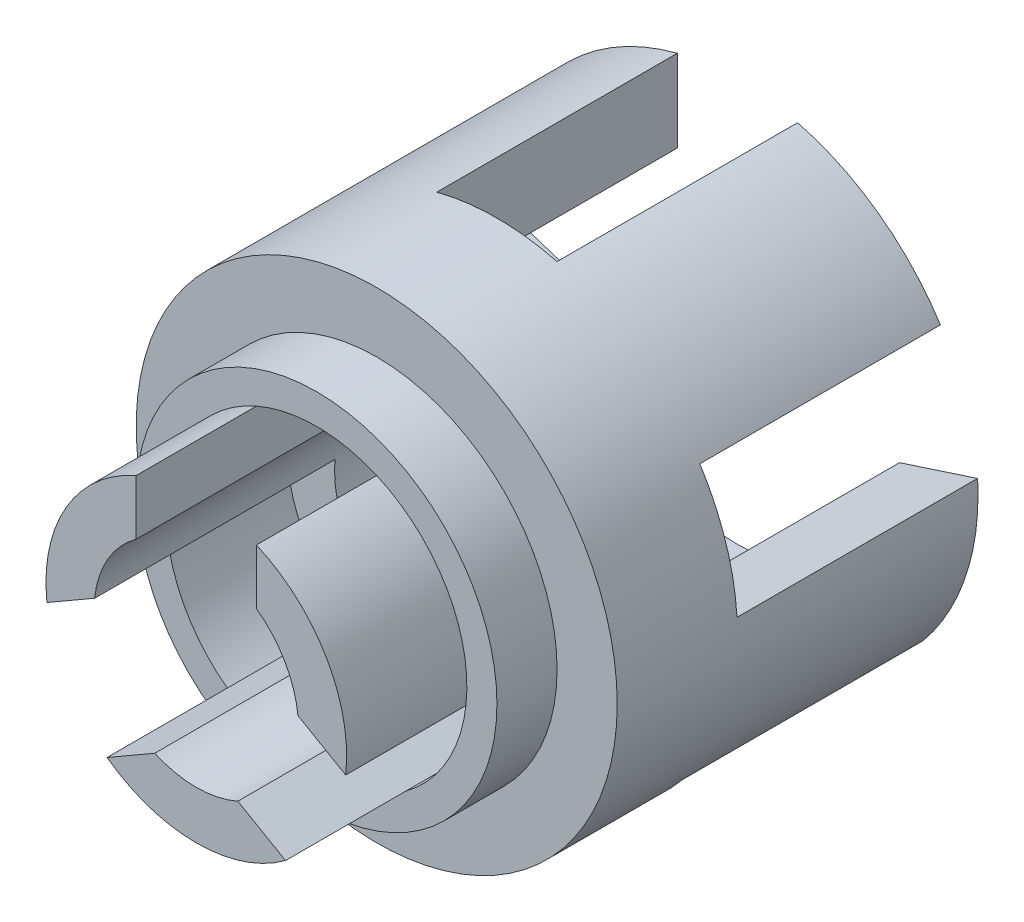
from build123d import *
from build123d.topology import SkipClean

# Parameters (mm, degrees)
SKETCH1_R           = 5.08
BOSS_EXTRUDE1_DEPTH = 7.62
SKETCH2_R           = 3.81
BOSS_EXTRUDE2_DEPTH = 1.27
SKETCH3_R           = 2.159
CUT_EXTRUDE1_DEPTH  = 12.43
SKETCH4_R           = 3.429
CUT_EXTRUDE2_DEPTH  = 5.08
CUT_EXTRUDE4_DEPTH  = 5.08
BOSS_EXTRUDE3_DEPTH = 2.54
CUT_EXTRUDE5_START  = -1.27
CUT_EXTRUDE5_DEPTH  = 1.27


with BuildPart() as part:
    # Sketch1 → Boss-Extrude1 (new body)
    with BuildSketch(Plane.XY):
        Circle(SKETCH1_R)
    extrude(amount=-BOSS_EXTRUDE1_DEPTH)

    # Sketch2 → Boss-Extrude2 (add)
    with BuildSketch(Plane.XY):
        Circle(SKETCH2_R)
        with BuildLine():
            Line((-1.27, 0.842422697), (-1.27, 2.909935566))
            ThreePointArc((-1.27, 2.909935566), (0, 3.175), (1.27, 2.909935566))
            Line((1.27, 2.909935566), (1.27, 0.842422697))
            ThreePointArc((1.27, 0.842422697), (1.319822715, 0.762), (1.364559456, 0.678640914))
            Line((1.364559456, 0.678640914), (3.155078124, -0.35511552))
            ThreePointArc((3.155078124, -0.35511552), (2.749630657, -1.5875), (1.885078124, -2.554820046))
            Line((1.885078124, -2.554820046), (0.094559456, -1.521063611))
            ThreePointArc((0.094559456, -1.521063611), (0, -1.524), (-0.094559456, -1.521063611))
            Line((-0.094559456, -1.521063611), (-1.885078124, -2.554820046))
            ThreePointArc((-1.885078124, -2.554820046), (-2.749630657, -1.5875), (-3.155078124, -0.35511552))
            Line((-3.155078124, -0.35511552), (-1.364559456, 0.678640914))
            ThreePointArc((-1.364559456, 0.678640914), (-1.319822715, 0.762), (-1.27, 0.842422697))
        make_face(mode=Mode.SUBTRACT)
    extrude(amount=BOSS_EXTRUDE2_DEPTH)

    # Sketch3 → Cut-Extrude1 (cut, through all)
    with BuildSketch(Plane(origin=(0, 0, -7.62), x_dir=(-1, 0, 0), z_dir=(0, 0, -1))):
        Circle(SKETCH3_R)
    extrude(amount=-CUT_EXTRUDE1_DEPTH, mode=Mode.SUBTRACT)

    # Sketch4 → Cut-Extrude2 (cut)
    with BuildSketch(Plane(origin=(0, 0, -7.62), x_dir=(-1, 0, 0), z_dir=(0, 0, -1))):
        Circle(SKETCH4_R)
    extrude(amount=-CUT_EXTRUDE2_DEPTH, mode=Mode.SUBTRACT)

    # Sketch5 → Cut-Extrude4 (cut)
    with BuildSketch(Plane(origin=(0, 0, -7.62), x_dir=(-1, 0, 0), z_dir=(0, 0, -1))):
        with BuildLine():
            ThreePointArc((-1.27, 2.909935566), (0, 3.175), (1.27, 2.909935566))
            Line((1.27, 2.909935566), (1.27, 4.91868885))
            ThreePointArc((1.27, 4.91868885), (0, 5.08), (-1.27, 4.91868885))
            Line((-1.27, 4.91868885), (-1.27, 2.909935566))
        make_face()
        with BuildLine():
            Line((4.285499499, 2.72780022), (2.375061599, 2.107061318))
            ThreePointArc((2.375061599, 2.107061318), (3.019604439, 0.981128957), (3.159964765, -0.308622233))
            Line((3.159964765, -0.308622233), (5.070402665, 0.312116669))
            ThreePointArc((5.070402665, 0.312116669), (4.831367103, 1.569806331), (4.285499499, 2.72780022))
        make_face()
        with BuildLine():
            Line((3.918584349, -3.232815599), (2.737868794, -1.607700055))
            ThreePointArc((2.737868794, -1.607700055), (1.866218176, -2.568628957), (0.682965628, -3.100674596))
            Line((0.682965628, -3.100674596), (1.863681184, -4.72579014))
            ThreePointArc((1.863681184, -4.72579014), (2.985949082, -4.109806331), (3.918584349, -3.232815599))
        make_face()
        with BuildLine():
            Line((-1.863681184, -4.72579014), (-0.682965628, -3.100674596))
            ThreePointArc((-0.682965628, -3.100674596), (-1.866218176, -2.568628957), (-2.737868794, -1.607700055))
            Line((-2.737868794, -1.607700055), (-3.918584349, -3.232815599))
            ThreePointArc((-3.918584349, -3.232815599), (-2.985949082, -4.109806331), (-1.863681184, -4.72579014))
        make_face()
        with BuildLine():
            Line((-5.070402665, 0.312116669), (-3.159964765, -0.308622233))
            ThreePointArc((-3.159964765, -0.308622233), (-3.019604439, 0.981128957), (-2.375061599, 2.107061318))
            Line((-2.375061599, 2.107061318), (-4.285499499, 2.72780022))
            ThreePointArc((-4.285499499, 2.72780022), (-4.831367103, 1.569806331), (-5.070402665, 0.312116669))
        make_face()
    extrude(amount=-CUT_EXTRUDE4_DEPTH, mode=Mode.SUBTRACT)

    # Sketch6 → Boss-Extrude3 (add)
    with SkipClean():  # the faces are left unmerged after this step: merging them gives an invalid solid
        with BuildSketch(Plane.XY.offset(1.27)):
            with BuildLine():
                Line((-1.27, 1.74596134), (-1.27, 2.909935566))
                ThreePointArc((-1.27, 2.909935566), (-2.749630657, 1.5875), (-3.155078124, -0.35511552))
                Line((-3.155078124, -0.35511552), (-2.147046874, 0.226871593))
                ThreePointArc((-2.147046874, 0.226871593), (-1.869748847, 1.0795), (-1.27, 1.74596134))
            make_face()
            with BuildLine():
                Line((1.27, 1.74596134), (1.27, 2.909935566))
                ThreePointArc((1.27, 2.909935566), (2.749630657, 1.5875), (3.155078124, -0.35511552))
                Line((3.155078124, -0.35511552), (2.147046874, 0.226871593))
                ThreePointArc((2.147046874, 0.226871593), (1.869748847, 1.0795), (1.27, 1.74596134))
            make_face()
            with BuildLine():
                Line((0.877046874, -1.972832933), (1.885078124, -2.554820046))
                ThreePointArc((1.885078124, -2.554820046), (0, -3.175), (-1.885078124, -2.554820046))
                Line((-1.885078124, -2.554820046), (-0.877046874, -1.972832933))
                ThreePointArc((-0.877046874, -1.972832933), (0, -2.159), (0.877046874, -1.972832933))
            make_face()
        extrude(amount=BOSS_EXTRUDE3_DEPTH)

    # Sketch7 → Cut-Extrude5 (cut)
    with SkipClean():  # the faces are left unmerged after this step: merging them gives an invalid solid
        with BuildSketch(Plane.XY.offset(CUT_EXTRUDE5_START)):
            with BuildLine():
                Line((1.27, 1.74596134), (1.27, 2.909935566))
                ThreePointArc((1.27, 2.909935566), (0, 3.175), (-1.27, 2.909935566))
                Line((-1.27, 2.909935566), (-1.27, 1.74596134))
                ThreePointArc((-1.27, 1.74596134), (0, 2.159), (1.27, 1.74596134))
            make_face()
            with BuildLine():
                Line((2.147046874, 0.226871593), (3.155078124, -0.35511552))
                ThreePointArc((3.155078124, -0.35511552), (2.749630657, -1.5875), (1.885078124, -2.554820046))
                Line((1.885078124, -2.554820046), (0.877046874, -1.972832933))
                ThreePointArc((0.877046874, -1.972832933), (1.869748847, -1.0795), (2.147046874, 0.226871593))
            make_face()
            with BuildLine():
                Line((-2.147046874, 0.226871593), (-3.155078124, -0.35511552))
                ThreePointArc((-3.155078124, -0.35511552), (-2.749630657, -1.5875), (-1.885078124, -2.554820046))
                Line((-1.885078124, -2.554820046), (-0.877046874, -1.972832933))
                ThreePointArc((-0.877046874, -1.972832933), (-1.869748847, -1.0795), (-2.147046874, 0.226871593))
            make_face()
        extrude(amount=CUT_EXTRUDE5_DEPTH, mode=Mode.SUBTRACT)


solid = part.part
